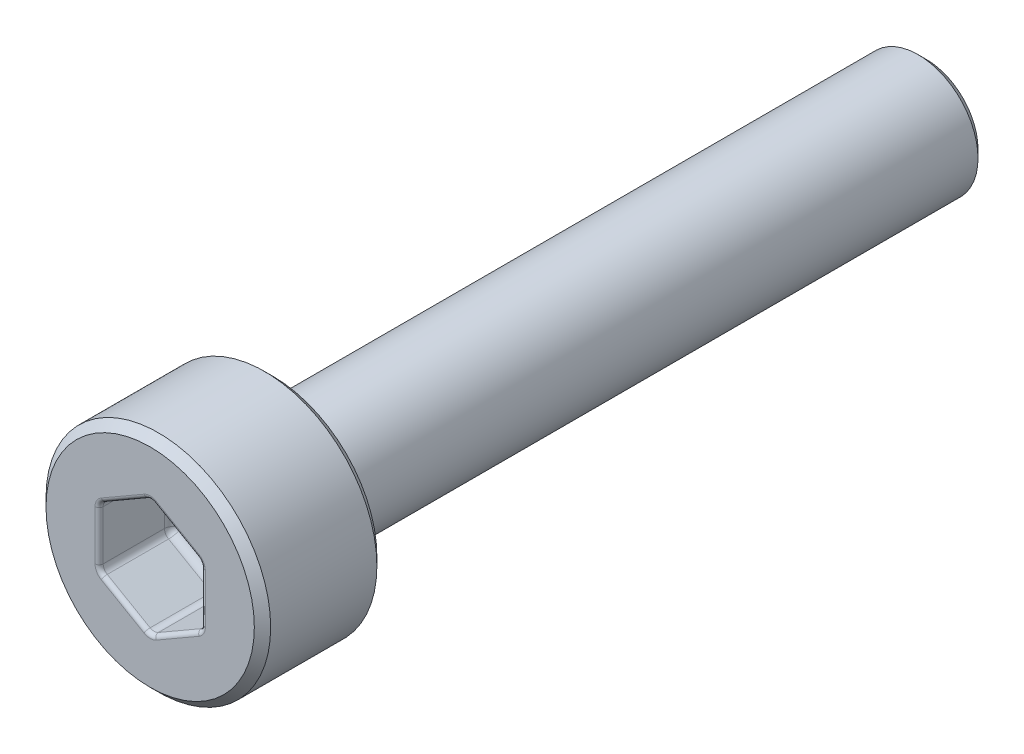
from build123d import *

# Parameters (mm, degrees)
SCHNITT_LINEAR_AUSTRAGEN1_DEPTH = 1.8
FASE1_SIZE                      = 0.2
VERRUNDUNG1_R                   = 0.2
VERRUNDUNG2_R                   = 0.1


with BuildPart() as part:
    # Skizze1 → Rotation1 (revolve)
    with BuildSketch(Plane(origin=(0, 0, 0), x_dir=(0, 0, -1), z_dir=(1, 0, 0)), mode=Mode.PRIVATE) as rotation1_sk:
        Polygon((-3, 0), (-3, 2.75), (0, 2.75), (0, 1.465), (16, 1.465), (16, 0), align=None)
    revolve(rotation1_sk.sketch.rotate(Axis((0, 0, 21.919879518), (0, 0, -1)), 90), axis=Axis((0, 0, 21.919879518), (0, 0, -1)))

    # Skizze2 → Schnitt-Linear austragen1 (cut)
    with BuildSketch(Plane.XY.offset(3)):
        Polygon((1.25, -0.721687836), (1.25, 0.721687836), (0, 1.443375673), (-1.25, 0.721687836), (-1.25, -0.721687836), (0, -1.443375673), align=None)
    extrude(amount=-SCHNITT_LINEAR_AUSTRAGEN1_DEPTH, mode=Mode.SUBTRACT)

    # Fase1
    fase1_edges = [part.edges().sort_by_distance(p)[0] for p in [
        (-1.465, 0, -16),
        (-2.75, 0, 0),
        (-2.75, 0, 3),
    ]]
    chamfer(fase1_edges, length=FASE1_SIZE)

    # Verrundung1
    verrundung1_edges = [part.edges().sort_by_distance(p)[0] for p in [
        (0.625, -1.082531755, 1.2),
        (1.25, -0.721687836, 2.1),
        (-0.625, -1.082531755, 1.2),
        (0, -1.443375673, 2.1),
        (-1.25, 0, 1.2),
        (-1.25, -0.721687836, 2.1),
        (-0.625, 1.082531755, 1.2),
        (-1.25, 0.721687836, 2.1),
        (0.625, 1.082531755, 1.2),
        (0, 1.443375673, 2.1),
        (1.25, 0, 1.2),
        (1.25, 0.721687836, 2.1),
        (-1.465, 0, 0),
    ]]
    fillet(verrundung1_edges, radius=VERRUNDUNG1_R)

    # Verrundung2
    verrundung2_edges = [part.edges().sort_by_distance(p)[0] for p in [
        (-0.625, -1.082531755, 3),
        (-1.25, 0, 3),
        (-0.625, 1.082531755, 3),
        (0.625, 1.082531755, 3),
        (1.25, 0, 3),
        (0.625, -1.082531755, 3),
        (-1.223205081, -0.706217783, 3),
        (0, -1.412435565, 3),
        (1.223205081, -0.706217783, 3),
        (1.223205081, 0.706217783, 3),
        (0, 1.412435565, 3),
        (-1.223205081, 0.706217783, 3),
    ]]
    fillet(verrundung2_edges, radius=VERRUNDUNG2_R)


solid = part.part
